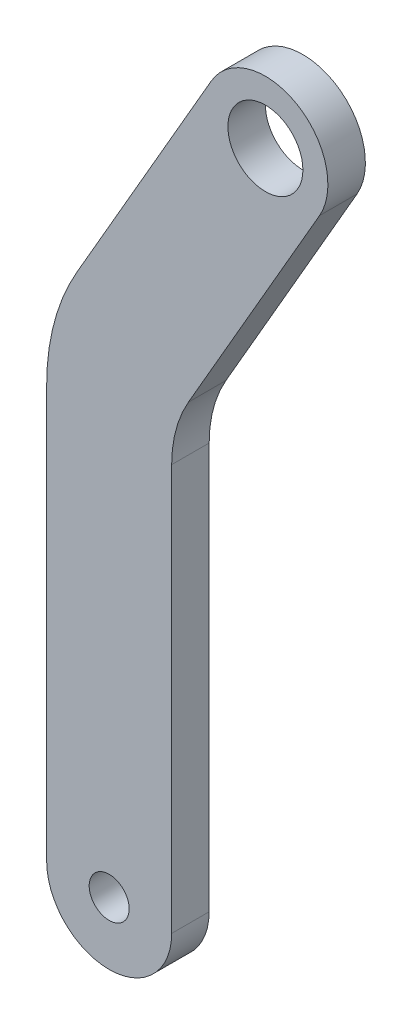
from build123d import *

# Parameters (mm, degrees)
ESQUISSE1_R        = 1.6
ESQUISSE1_R_2      = 3
BOSS_EXTRU_1_DEPTH = 3


with BuildPart() as part:
    # Esquisse1 → Boss.-Extru.1 (new body)
    with BuildSketch(Plane.XY):
        with BuildLine():
            Line((-5, -36.5), (-5, -3.483339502))
            ThreePointArc((-5, -3.483339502), (-4.386664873, 1.17540331), (-2.588457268, 5.516660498))
            Line((-2.588457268, 5.516660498), (8.169872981, 24.150635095))
            ThreePointArc((8.169872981, 24.150635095), (15, 25.980762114), (16.830127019, 19.150635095))
            Line((16.830127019, 19.150635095), (6.339745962, 0.980762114))
            ThreePointArc((6.339745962, 0.980762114), (5.340741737, -1.431047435), (5, -4.019237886))
            Line((5, -4.019237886), (5, -36.5))
            ThreePointArc((5, -36.5), (0, -41.5), (-5, -36.5))
        make_face()
        with Locations((0, -36.5)):
            Circle(ESQUISSE1_R, mode=Mode.SUBTRACT)
        with Locations((12.5, 21.650635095)):
            Circle(ESQUISSE1_R_2, mode=Mode.SUBTRACT)
    extrude(amount=BOSS_EXTRU_1_DEPTH)


solid = part.part
